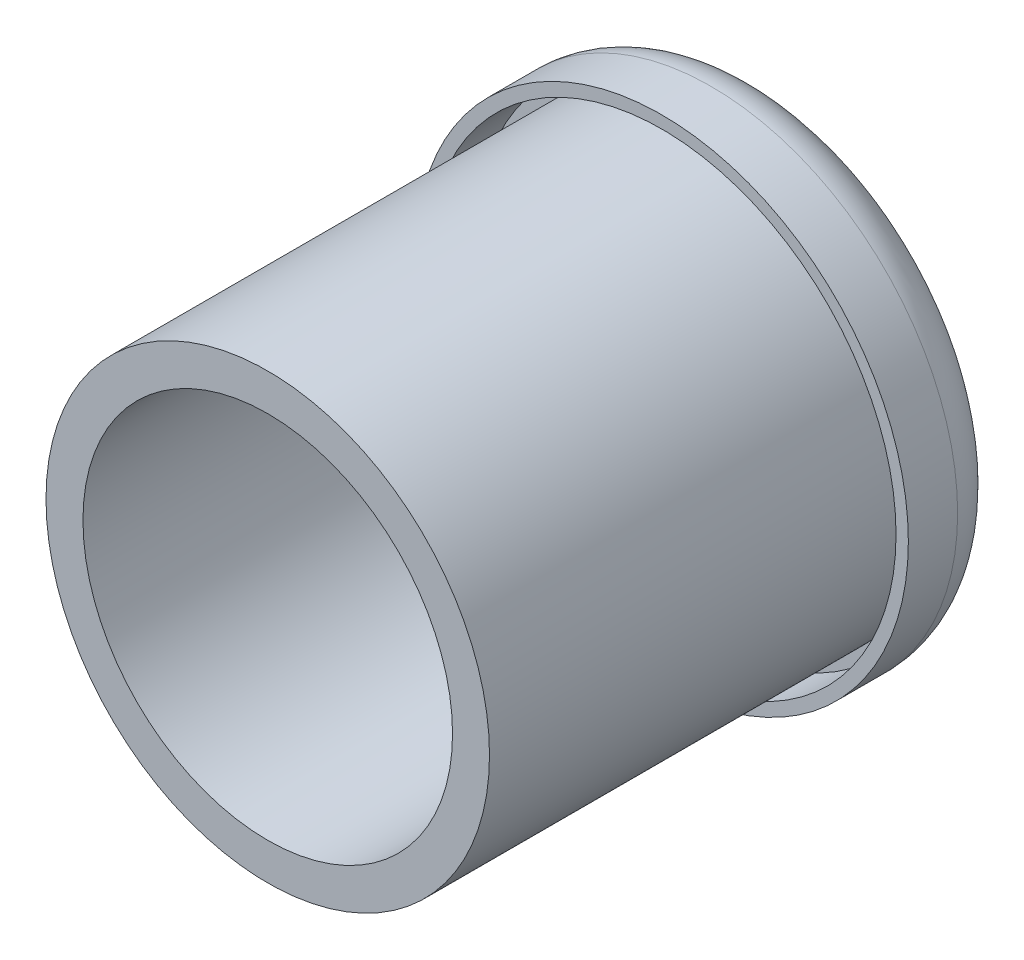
ISO-10303-21;
HEADER;
FILE_DESCRIPTION(('STEP AP214'),'2;1');
FILE_NAME('part.step','',(''),(''),'','','');
FILE_SCHEMA(('AUTOMOTIVE_DESIGN { 1 0 10303 214 1 1 1 1 }'));
ENDSEC;
DATA;
#1=APPLICATION_CONTEXT('core data for automotive mechanical design processes');
#2=APPLICATION_PROTOCOL_DEFINITION('international standard','automotive_design',2000,#1);
#3=PRODUCT_CONTEXT('',#1,'mechanical');
#4=PRODUCT('Part','Part','',(#3));
#5=PRODUCT_RELATED_PRODUCT_CATEGORY('part','',(#4));
#6=PRODUCT_DEFINITION_FORMATION('','',#4);
#7=PRODUCT_DEFINITION_CONTEXT('part definition',#1,'design');
#8=PRODUCT_DEFINITION('design','',#6,#7);
#9=PRODUCT_DEFINITION_SHAPE('','',#8);
#10=(LENGTH_UNIT() NAMED_UNIT(*) SI_UNIT(.MILLI.,.METRE.));
#11=(NAMED_UNIT(*) PLANE_ANGLE_UNIT() SI_UNIT($,.RADIAN.));
#12=(NAMED_UNIT(*) SI_UNIT($,.STERADIAN.) SOLID_ANGLE_UNIT());
#13=UNCERTAINTY_MEASURE_WITH_UNIT(LENGTH_MEASURE(1.E-05),#10,'distance_accuracy_value','');
#14=(GEOMETRIC_REPRESENTATION_CONTEXT(3) GLOBAL_UNCERTAINTY_ASSIGNED_CONTEXT((#13)) GLOBAL_UNIT_ASSIGNED_CONTEXT((#10,
#11,#12)) REPRESENTATION_CONTEXT('',''));
#15=CARTESIAN_POINT('',(0.,0.,0.));
#16=DIRECTION('',(0.,0.,1.));
#17=DIRECTION('',(1.,0.,0.));
#18=AXIS2_PLACEMENT_3D('',#15,#16,#17);
#19=CARTESIAN_POINT('',(0.,0.,10.));
#20=DIRECTION('',(0.,0.,-1.));
#21=DIRECTION('',(-1.,0.,0.));
#22=AXIS2_PLACEMENT_3D('',#19,#20,#21);
#23=CYLINDRICAL_SURFACE('',#22,5.);
#24=CARTESIAN_POINT('',(0.,0.,0.999999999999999));
#25=DIRECTION('',(0.,0.,1.));
#26=DIRECTION('',(1.,0.,0.));
#27=AXIS2_PLACEMENT_3D('',#24,#25,#26);
#28=CIRCLE('',#27,5.);
#29=CARTESIAN_POINT('',(5.,0.,0.999999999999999));
#30=VERTEX_POINT('',#29);
#31=EDGE_CURVE('E36',#30,#30,#28,.T.);
#32=ORIENTED_EDGE('',*,*,#31,.T.);
#33=EDGE_LOOP('',(#32));
#34=FACE_BOUND('',#33,.T.);
#35=CARTESIAN_POINT('',(0.,0.,2.));
#36=DIRECTION('',(0.,0.,1.));
#37=DIRECTION('',(1.,0.,0.));
#38=AXIS2_PLACEMENT_3D('',#35,#36,#37);
#39=CIRCLE('',#38,5.);
#40=CARTESIAN_POINT('',(5.,0.,2.));
#41=VERTEX_POINT('',#40);
#42=EDGE_CURVE('E56',#41,#41,#39,.T.);
#43=ORIENTED_EDGE('',*,*,#42,.F.);
#44=EDGE_LOOP('',(#43));
#45=FACE_BOUND('',#44,.T.);
#46=ADVANCED_FACE('F29',(#34,#45),#23,.T.);
#47=CARTESIAN_POINT('',(0.,0.,1.));
#48=DIRECTION('',(0.,0.,1.));
#49=DIRECTION('',(1.,0.,0.));
#50=AXIS2_PLACEMENT_3D('',#47,#48,#49);
#51=CYLINDRICAL_SURFACE('',#50,4.75);
#52=CARTESIAN_POINT('',(0.,0.,1.));
#53=DIRECTION('',(0.,0.,1.));
#54=DIRECTION('',(1.,0.,0.));
#55=AXIS2_PLACEMENT_3D('',#52,#53,#54);
#56=CIRCLE('',#55,4.75);
#57=CARTESIAN_POINT('',(4.75,0.,1.));
#58=VERTEX_POINT('',#57);
#59=EDGE_CURVE('E48',#58,#58,#56,.T.);
#60=ORIENTED_EDGE('',*,*,#59,.F.);
#61=EDGE_LOOP('',(#60));
#62=FACE_BOUND('',#61,.T.);
#63=CARTESIAN_POINT('',(0.,0.,2.));
#64=DIRECTION('',(0.,0.,1.));
#65=DIRECTION('',(1.,0.,0.));
#66=AXIS2_PLACEMENT_3D('',#63,#64,#65);
#67=CIRCLE('',#66,4.75);
#68=CARTESIAN_POINT('',(4.75,0.,2.));
#69=VERTEX_POINT('',#68);
#70=EDGE_CURVE('E61',#69,#69,#67,.T.);
#71=ORIENTED_EDGE('',*,*,#70,.T.);
#72=EDGE_LOOP('',(#71));
#73=FACE_BOUND('',#72,.T.);
#74=ADVANCED_FACE('F65',(#62,#73),#51,.F.);
#75=CARTESIAN_POINT('',(0.,0.,10.));
#76=DIRECTION('',(0.,0.,1.));
#77=DIRECTION('',(1.,0.,0.));
#78=AXIS2_PLACEMENT_3D('',#75,#76,#77);
#79=PLANE('',#78);
#80=CARTESIAN_POINT('',(0.,0.,10.));
#81=DIRECTION('',(0.,0.,1.));
#82=DIRECTION('',(1.,0.,0.));
#83=AXIS2_PLACEMENT_3D('',#80,#81,#82);
#84=CIRCLE('',#83,3.75);
#85=CARTESIAN_POINT('',(3.75,0.,10.));
#86=VERTEX_POINT('',#85);
#87=EDGE_CURVE('E44',#86,#86,#84,.T.);
#88=ORIENTED_EDGE('',*,*,#87,.F.);
#89=EDGE_LOOP('',(#88));
#90=FACE_BOUND('',#89,.T.);
#91=CARTESIAN_POINT('',(0.,0.,10.));
#92=DIRECTION('',(0.,0.,1.));
#93=DIRECTION('',(1.,0.,0.));
#94=AXIS2_PLACEMENT_3D('',#91,#92,#93);
#95=CIRCLE('',#94,4.5);
#96=CARTESIAN_POINT('',(4.5,0.,10.));
#97=VERTEX_POINT('',#96);
#98=EDGE_CURVE('E53',#97,#97,#95,.T.);
#99=ORIENTED_EDGE('',*,*,#98,.T.);
#100=EDGE_LOOP('',(#99));
#101=FACE_BOUND('',#100,.T.);
#102=ADVANCED_FACE('F78',(#90,#101),#79,.T.);
#103=CARTESIAN_POINT('',(0.,0.,0.));
#104=DIRECTION('',(0.,0.,1.));
#105=DIRECTION('',(1.,0.,0.));
#106=AXIS2_PLACEMENT_3D('',#103,#104,#105);
#107=PLANE('',#106);
#108=CARTESIAN_POINT('',(0.,0.,0.));
#109=DIRECTION('',(0.,0.,1.));
#110=DIRECTION('',(1.,0.,0.));
#111=AXIS2_PLACEMENT_3D('',#108,#109,#110);
#112=CIRCLE('',#111,4.);
#113=CARTESIAN_POINT('',(4.,0.,0.));
#114=VERTEX_POINT('',#113);
#115=EDGE_CURVE('E10',#114,#114,#112,.F.);
#116=ORIENTED_EDGE('',*,*,#115,.T.);
#117=EDGE_LOOP('',(#116));
#118=FACE_BOUND('',#117,.T.);
#119=CARTESIAN_POINT('',(0.,0.,0.));
#120=DIRECTION('',(0.,0.,1.));
#121=DIRECTION('',(1.,0.,0.));
#122=AXIS2_PLACEMENT_3D('',#119,#120,#121);
#123=CIRCLE('',#122,3.75);
#124=CARTESIAN_POINT('',(3.75,0.,0.));
#125=VERTEX_POINT('',#124);
#126=EDGE_CURVE('E40',#125,#125,#123,.T.);
#127=ORIENTED_EDGE('',*,*,#126,.T.);
#128=EDGE_LOOP('',(#127));
#129=FACE_BOUND('',#128,.T.);
#130=ADVANCED_FACE('F82',(#118,#129),#107,.F.);
#131=CARTESIAN_POINT('',(0.,0.,0.));
#132=DIRECTION('',(0.,0.,1.));
#133=DIRECTION('',(1.,0.,0.));
#134=AXIS2_PLACEMENT_3D('',#131,#132,#133);
#135=CYLINDRICAL_SURFACE('',#134,3.75);
#136=ORIENTED_EDGE('',*,*,#126,.F.);
#137=EDGE_LOOP('',(#136));
#138=FACE_BOUND('',#137,.T.);
#139=ORIENTED_EDGE('',*,*,#87,.T.);
#140=EDGE_LOOP('',(#139));
#141=FACE_BOUND('',#140,.T.);
#142=ADVANCED_FACE('F85',(#138,#141),#135,.F.);
#143=CARTESIAN_POINT('',(0.,0.,1.));
#144=DIRECTION('',(0.,0.,1.));
#145=DIRECTION('',(1.,0.,0.));
#146=AXIS2_PLACEMENT_3D('',#143,#144,#145);
#147=PLANE('',#146);
#148=CARTESIAN_POINT('',(0.,0.,1.));
#149=DIRECTION('',(0.,0.,1.));
#150=DIRECTION('',(1.,0.,0.));
#151=AXIS2_PLACEMENT_3D('',#148,#149,#150);
#152=CIRCLE('',#151,4.5);
#153=CARTESIAN_POINT('',(4.5,0.,1.));
#154=VERTEX_POINT('',#153);
#155=EDGE_CURVE('E52',#154,#154,#152,.T.);
#156=ORIENTED_EDGE('',*,*,#155,.F.);
#157=EDGE_LOOP('',(#156));
#158=FACE_BOUND('',#157,.T.);
#159=ORIENTED_EDGE('',*,*,#59,.T.);
#160=EDGE_LOOP('',(#159));
#161=FACE_BOUND('',#160,.T.);
#162=ADVANCED_FACE('F90',(#158,#161),#147,.T.);
#163=CARTESIAN_POINT('',(0.,0.,1.));
#164=DIRECTION('',(0.,0.,1.));
#165=DIRECTION('',(1.,0.,0.));
#166=AXIS2_PLACEMENT_3D('',#163,#164,#165);
#167=CYLINDRICAL_SURFACE('',#166,4.5);
#168=ORIENTED_EDGE('',*,*,#155,.T.);
#169=EDGE_LOOP('',(#168));
#170=FACE_BOUND('',#169,.T.);
#171=ORIENTED_EDGE('',*,*,#98,.F.);
#172=EDGE_LOOP('',(#171));
#173=FACE_BOUND('',#172,.T.);
#174=ADVANCED_FACE('F70',(#170,#173),#167,.T.);
#175=CARTESIAN_POINT('',(0.,0.,2.));
#176=DIRECTION('',(0.,0.,1.));
#177=DIRECTION('',(1.,0.,0.));
#178=AXIS2_PLACEMENT_3D('',#175,#176,#177);
#179=PLANE('',#178);
#180=ORIENTED_EDGE('',*,*,#70,.F.);
#181=EDGE_LOOP('',(#180));
#182=FACE_BOUND('',#181,.T.);
#183=ORIENTED_EDGE('',*,*,#42,.T.);
#184=EDGE_LOOP('',(#183));
#185=FACE_BOUND('',#184,.T.);
#186=ADVANCED_FACE('F67',(#182,#185),#179,.T.);
#187=CARTESIAN_POINT('',(0.,0.,0.999999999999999));
#188=DIRECTION('',(0.,0.,1.));
#189=DIRECTION('',(1.,0.,0.));
#190=AXIS2_PLACEMENT_3D('',#187,#188,#189);
#191=TOROIDAL_SURFACE('',#190,4.,1.);
#192=ORIENTED_EDGE('',*,*,#115,.F.);
#193=EDGE_LOOP('',(#192));
#194=FACE_BOUND('',#193,.T.);
#195=ORIENTED_EDGE('',*,*,#31,.F.);
#196=EDGE_LOOP('',(#195));
#197=FACE_BOUND('',#196,.T.);
#198=ADVANCED_FACE('F31',(#194,#197),#191,.T.);
#199=CLOSED_SHELL('',(#46,#74,#102,#130,#142,#162,#174,#186,#198));
#200=MANIFOLD_SOLID_BREP('B2',#199);
#201=ADVANCED_BREP_SHAPE_REPRESENTATION('',(#18,#200),#14);
#202=SHAPE_DEFINITION_REPRESENTATION(#9,#201);
ENDSEC;
END-ISO-10303-21;
